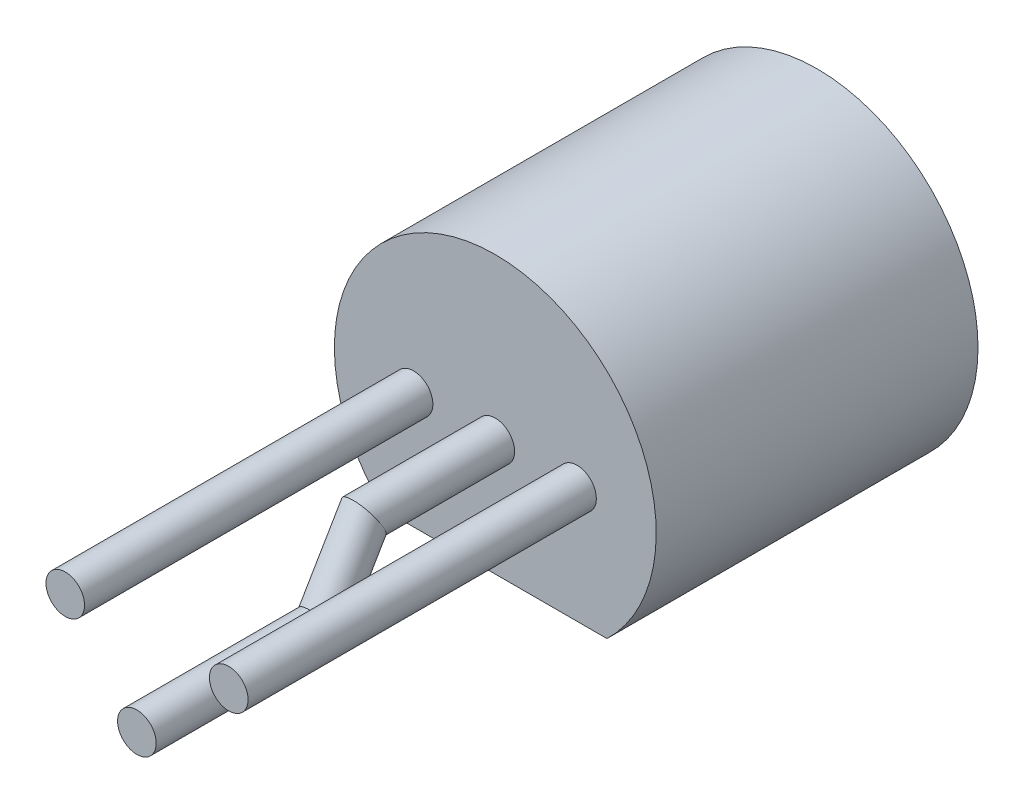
ISO-10303-21;
HEADER;
FILE_DESCRIPTION(('STEP AP214'),'2;1');
FILE_NAME('part.step','',(''),(''),'','','');
FILE_SCHEMA(('AUTOMOTIVE_DESIGN { 1 0 10303 214 1 1 1 1 }'));
ENDSEC;
DATA;
#1=APPLICATION_CONTEXT('core data for automotive mechanical design processes');
#2=APPLICATION_PROTOCOL_DEFINITION('international standard','automotive_design',2000,#1);
#3=PRODUCT_CONTEXT('',#1,'mechanical');
#4=PRODUCT('Part','Part','',(#3));
#5=PRODUCT_RELATED_PRODUCT_CATEGORY('part','',(#4));
#6=PRODUCT_DEFINITION_FORMATION('','',#4);
#7=PRODUCT_DEFINITION_CONTEXT('part definition',#1,'design');
#8=PRODUCT_DEFINITION('design','',#6,#7);
#9=PRODUCT_DEFINITION_SHAPE('','',#8);
#10=(LENGTH_UNIT() NAMED_UNIT(*) SI_UNIT(.MILLI.,.METRE.));
#11=(NAMED_UNIT(*) PLANE_ANGLE_UNIT() SI_UNIT($,.RADIAN.));
#12=(NAMED_UNIT(*) SI_UNIT($,.STERADIAN.) SOLID_ANGLE_UNIT());
#13=UNCERTAINTY_MEASURE_WITH_UNIT(LENGTH_MEASURE(1.E-05),#10,'distance_accuracy_value','');
#14=(GEOMETRIC_REPRESENTATION_CONTEXT(3) GLOBAL_UNCERTAINTY_ASSIGNED_CONTEXT((#13)) GLOBAL_UNIT_ASSIGNED_CONTEXT((#10,
#11,#12)) REPRESENTATION_CONTEXT('',''));
#15=CARTESIAN_POINT('',(0.,0.,0.));
#16=DIRECTION('',(0.,0.,1.));
#17=DIRECTION('',(1.,0.,0.));
#18=AXIS2_PLACEMENT_3D('',#15,#16,#17);
#19=CARTESIAN_POINT('',(0.,0.,5.));
#20=DIRECTION('',(0.,0.,1.));
#21=DIRECTION('',(1.,0.,0.));
#22=AXIS2_PLACEMENT_3D('',#19,#20,#21);
#23=PLANE('',#22);
#24=CARTESIAN_POINT('',(0.,0.,5.));
#25=DIRECTION('',(0.,0.,1.));
#26=DIRECTION('',(1.,0.,0.));
#27=AXIS2_PLACEMENT_3D('',#24,#25,#26);
#28=CIRCLE('',#27,0.3);
#29=CARTESIAN_POINT('',(0.3,0.,5.));
#30=VERTEX_POINT('',#29);
#31=EDGE_CURVE('E12',#30,#30,#28,.T.);
#32=ORIENTED_EDGE('',*,*,#31,.F.);
#33=EDGE_LOOP('',(#32));
#34=FACE_BOUND('',#33,.T.);
#35=CARTESIAN_POINT('',(1.27,0.,5.));
#36=DIRECTION('',(0.,0.,1.));
#37=DIRECTION('',(1.,0.,0.));
#38=AXIS2_PLACEMENT_3D('',#35,#36,#37);
#39=CIRCLE('',#38,0.3);
#40=CARTESIAN_POINT('',(1.57,0.,5.));
#41=VERTEX_POINT('',#40);
#42=EDGE_CURVE('E37',#41,#41,#39,.T.);
#43=ORIENTED_EDGE('',*,*,#42,.F.);
#44=EDGE_LOOP('',(#43));
#45=FACE_BOUND('',#44,.T.);
#46=CARTESIAN_POINT('',(0.,0.,5.));
#47=DIRECTION('',(0.,0.,1.));
#48=DIRECTION('',(1.,0.,0.));
#49=AXIS2_PLACEMENT_3D('',#46,#47,#48);
#50=CIRCLE('',#49,2.5);
#51=CARTESIAN_POINT('',(1.73493515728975,-1.8,5.));
#52=VERTEX_POINT('',#51);
#53=CARTESIAN_POINT('',(-1.73493515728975,-1.8,5.));
#54=VERTEX_POINT('',#53);
#55=EDGE_CURVE('E65',#52,#54,#50,.T.);
#56=ORIENTED_EDGE('',*,*,#55,.T.);
#57=DIRECTION('',(1.,0.,0.));
#58=VECTOR('',#57,1.);
#59=CARTESIAN_POINT('',(-1.73493515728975,-1.8,5.));
#60=LINE('',#59,#58);
#61=EDGE_CURVE('E48',#54,#52,#60,.T.);
#62=ORIENTED_EDGE('',*,*,#61,.T.);
#63=EDGE_LOOP('',(#56,#62));
#64=FACE_BOUND('',#63,.T.);
#65=CARTESIAN_POINT('',(-1.27,0.,5.));
#66=DIRECTION('',(0.,0.,1.));
#67=DIRECTION('',(1.,0.,0.));
#68=AXIS2_PLACEMENT_3D('',#65,#66,#67);
#69=CIRCLE('',#68,0.3);
#70=CARTESIAN_POINT('',(-0.97,0.,5.));
#71=VERTEX_POINT('',#70);
#72=EDGE_CURVE('E76',#71,#71,#69,.T.);
#73=ORIENTED_EDGE('',*,*,#72,.F.);
#74=EDGE_LOOP('',(#73));
#75=FACE_BOUND('',#74,.T.);
#76=ADVANCED_FACE('F33',(#34,#45,#64,#75),#23,.T.);
#77=CARTESIAN_POINT('',(0.,0.,5.));
#78=DIRECTION('',(0.,0.,-1.));
#79=DIRECTION('',(-1.,0.,0.));
#80=AXIS2_PLACEMENT_3D('',#77,#78,#79);
#81=CYLINDRICAL_SURFACE('',#80,2.5);
#82=CARTESIAN_POINT('',(0.,0.,0.));
#83=DIRECTION('',(0.,0.,1.));
#84=DIRECTION('',(1.,0.,0.));
#85=AXIS2_PLACEMENT_3D('',#82,#83,#84);
#86=CIRCLE('',#85,2.5);
#87=CARTESIAN_POINT('',(1.73493515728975,-1.8,0.));
#88=VERTEX_POINT('',#87);
#89=CARTESIAN_POINT('',(-1.73493515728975,-1.8,0.));
#90=VERTEX_POINT('',#89);
#91=EDGE_CURVE('E63',#88,#90,#86,.T.);
#92=ORIENTED_EDGE('',*,*,#91,.T.);
#93=DIRECTION('',(0.,0.,-1.));
#94=VECTOR('',#93,1.);
#95=CARTESIAN_POINT('',(-1.73493515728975,-1.8,5.));
#96=LINE('',#95,#94);
#97=EDGE_CURVE('E68',#54,#90,#96,.T.);
#98=ORIENTED_EDGE('',*,*,#97,.F.);
#99=ORIENTED_EDGE('',*,*,#55,.F.);
#100=DIRECTION('',(0.,0.,-1.));
#101=VECTOR('',#100,1.);
#102=CARTESIAN_POINT('',(1.73493515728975,-1.8,5.));
#103=LINE('',#102,#101);
#104=EDGE_CURVE('E72',#52,#88,#103,.T.);
#105=ORIENTED_EDGE('',*,*,#104,.T.);
#106=EDGE_LOOP('',(#92,#98,#99,#105));
#107=FACE_BOUND('',#106,.T.);
#108=ADVANCED_FACE('F35',(#107),#81,.T.);
#109=CARTESIAN_POINT('',(-1.73493515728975,-1.8,5.));
#110=DIRECTION('',(0.,1.,0.));
#111=DIRECTION('',(0.,0.,1.));
#112=AXIS2_PLACEMENT_3D('',#109,#110,#111);
#113=PLANE('',#112);
#114=DIRECTION('',(1.,0.,0.));
#115=VECTOR('',#114,1.);
#116=CARTESIAN_POINT('',(-1.73493515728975,-1.8,0.));
#117=LINE('',#116,#115);
#118=EDGE_CURVE('E60',#90,#88,#117,.T.);
#119=ORIENTED_EDGE('',*,*,#118,.T.);
#120=ORIENTED_EDGE('',*,*,#104,.F.);
#121=ORIENTED_EDGE('',*,*,#61,.F.);
#122=ORIENTED_EDGE('',*,*,#97,.T.);
#123=EDGE_LOOP('',(#119,#120,#121,#122));
#124=FACE_BOUND('',#123,.T.);
#125=ADVANCED_FACE('F69',(#124),#113,.F.);
#126=CARTESIAN_POINT('',(0.,0.,0.));
#127=DIRECTION('',(0.,0.,1.));
#128=DIRECTION('',(1.,0.,0.));
#129=AXIS2_PLACEMENT_3D('',#126,#127,#128);
#130=PLANE('',#129);
#131=ORIENTED_EDGE('',*,*,#91,.F.);
#132=ORIENTED_EDGE('',*,*,#118,.F.);
#133=EDGE_LOOP('',(#131,#132));
#134=FACE_BOUND('',#133,.T.);
#135=ADVANCED_FACE('F61',(#134),#130,.F.);
#136=CARTESIAN_POINT('',(-1.27,0.,10.4114232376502));
#137=DIRECTION('',(0.,0.,-1.));
#138=DIRECTION('',(-1.,0.,0.));
#139=AXIS2_PLACEMENT_3D('',#136,#137,#138);
#140=CYLINDRICAL_SURFACE('',#139,0.3);
#141=CARTESIAN_POINT('',(-1.27,0.,10.4114232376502));
#142=DIRECTION('',(0.,0.,1.));
#143=DIRECTION('',(1.,0.,0.));
#144=AXIS2_PLACEMENT_3D('',#141,#142,#143);
#145=CIRCLE('',#144,0.3);
#146=CARTESIAN_POINT('',(-0.97,0.,10.4114232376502));
#147=VERTEX_POINT('',#146);
#148=EDGE_CURVE('E73',#147,#147,#145,.T.);
#149=ORIENTED_EDGE('',*,*,#148,.F.);
#150=EDGE_LOOP('',(#149));
#151=FACE_BOUND('',#150,.T.);
#152=ORIENTED_EDGE('',*,*,#72,.T.);
#153=EDGE_LOOP('',(#152));
#154=FACE_BOUND('',#153,.T.);
#155=ADVANCED_FACE('F134',(#151,#154),#140,.T.);
#156=CARTESIAN_POINT('',(-1.27,0.,10.4114232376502));
#157=DIRECTION('',(0.,0.,1.));
#158=DIRECTION('',(1.,0.,0.));
#159=AXIS2_PLACEMENT_3D('',#156,#157,#158);
#160=PLANE('',#159);
#161=ORIENTED_EDGE('',*,*,#148,.T.);
#162=EDGE_LOOP('',(#161));
#163=FACE_BOUND('',#162,.T.);
#164=ADVANCED_FACE('F130',(#163),#160,.T.);
#165=CARTESIAN_POINT('',(1.27,0.,10.4114232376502));
#166=DIRECTION('',(0.,0.,-1.));
#167=DIRECTION('',(-1.,0.,0.));
#168=AXIS2_PLACEMENT_3D('',#165,#166,#167);
#169=CYLINDRICAL_SURFACE('',#168,0.3);
#170=CARTESIAN_POINT('',(1.27,0.,10.4114232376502));
#171=DIRECTION('',(0.,0.,-1.));
#172=DIRECTION('',(-1.,0.,0.));
#173=AXIS2_PLACEMENT_3D('',#170,#171,#172);
#174=CIRCLE('',#173,0.3);
#175=CARTESIAN_POINT('',(0.97,0.,10.4114232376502));
#176=VERTEX_POINT('',#175);
#177=EDGE_CURVE('E89',#176,#176,#174,.T.);
#178=ORIENTED_EDGE('',*,*,#177,.T.);
#179=EDGE_LOOP('',(#178));
#180=FACE_BOUND('',#179,.T.);
#181=ORIENTED_EDGE('',*,*,#42,.T.);
#182=EDGE_LOOP('',(#181));
#183=FACE_BOUND('',#182,.T.);
#184=ADVANCED_FACE('F126',(#180,#183),#169,.T.);
#185=CARTESIAN_POINT('',(1.27,0.,10.4114232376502));
#186=DIRECTION('',(0.,0.,1.));
#187=DIRECTION('',(-1.,0.,0.));
#188=AXIS2_PLACEMENT_3D('',#185,#186,#187);
#189=PLANE('',#188);
#190=ORIENTED_EDGE('',*,*,#177,.F.);
#191=EDGE_LOOP('',(#190));
#192=FACE_BOUND('',#191,.T.);
#193=ADVANCED_FACE('F122',(#192),#189,.T.);
#194=CARTESIAN_POINT('',(0.,-1.14244781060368,7.71128758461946));
#195=DIRECTION('',(0.,0.,1.));
#196=DIRECTION('',(0.,-1.,0.));
#197=AXIS2_PLACEMENT_3D('',#194,#195,#196);
#198=CYLINDRICAL_SURFACE('',#197,0.3);
#199=CARTESIAN_POINT('',(0.,-1.14244781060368,7.71128758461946));
#200=DIRECTION('',(0.,-0.496539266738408,0.868014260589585));
#201=DIRECTION('',(0.,-0.868014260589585,-0.496539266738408));
#202=AXIS2_PLACEMENT_3D('',#199,#200,#201);
#203=ELLIPSE('',#202,0.345616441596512,0.3);
#204=CARTESIAN_POINT('',(0.,-1.44244781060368,7.53967545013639));
#205=VERTEX_POINT('',#204);
#206=EDGE_CURVE('E96',#205,#205,#203,.F.);
#207=ORIENTED_EDGE('',*,*,#206,.F.);
#208=EDGE_LOOP('',(#207));
#209=FACE_BOUND('',#208,.T.);
#210=CARTESIAN_POINT('',(0.,-1.14244781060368,10.5689623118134));
#211=DIRECTION('',(0.,0.,1.));
#212=DIRECTION('',(0.,-1.,0.));
#213=AXIS2_PLACEMENT_3D('',#210,#211,#212);
#214=CIRCLE('',#213,0.3);
#215=CARTESIAN_POINT('',(0.,-1.44244781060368,10.5689623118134));
#216=VERTEX_POINT('',#215);
#217=EDGE_CURVE('E91',#216,#216,#214,.T.);
#218=ORIENTED_EDGE('',*,*,#217,.F.);
#219=EDGE_LOOP('',(#218));
#220=FACE_BOUND('',#219,.T.);
#221=ADVANCED_FACE('F117',(#209,#220),#198,.T.);
#222=CARTESIAN_POINT('',(0.,0.,7.0394781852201));
#223=DIRECTION('',(0.,-0.862006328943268,0.506897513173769));
#224=DIRECTION('',(0.,-0.506897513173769,-0.862006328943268));
#225=AXIS2_PLACEMENT_3D('',#222,#223,#224);
#226=CYLINDRICAL_SURFACE('',#225,0.3);
#227=CARTESIAN_POINT('',(0.,0.,7.0394781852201));
#228=DIRECTION('',(0.,-0.496539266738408,0.868014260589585));
#229=DIRECTION('',(0.,-0.868014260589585,-0.496539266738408));
#230=AXIS2_PLACEMENT_3D('',#227,#228,#229);
#231=ELLIPSE('',#230,0.345616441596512,0.3);
#232=CARTESIAN_POINT('',(0.,-0.3,6.86786605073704));
#233=VERTEX_POINT('',#232);
#234=EDGE_CURVE('E99',#233,#233,#231,.T.);
#235=ORIENTED_EDGE('',*,*,#234,.T.);
#236=EDGE_LOOP('',(#235));
#237=FACE_BOUND('',#236,.T.);
#238=ORIENTED_EDGE('',*,*,#206,.T.);
#239=EDGE_LOOP('',(#238));
#240=FACE_BOUND('',#239,.T.);
#241=ADVANCED_FACE('F103',(#237,#240),#226,.T.);
#242=CARTESIAN_POINT('',(0.,0.,7.88800632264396));
#243=DIRECTION('',(0.,0.,-1.));
#244=DIRECTION('',(-1.,0.,0.));
#245=AXIS2_PLACEMENT_3D('',#242,#243,#244);
#246=CYLINDRICAL_SURFACE('',#245,0.3);
#247=ORIENTED_EDGE('',*,*,#31,.T.);
#248=EDGE_LOOP('',(#247));
#249=FACE_BOUND('',#248,.T.);
#250=ORIENTED_EDGE('',*,*,#234,.F.);
#251=EDGE_LOOP('',(#250));
#252=FACE_BOUND('',#251,.T.);
#253=ADVANCED_FACE('F106',(#249,#252),#246,.T.);
#254=CARTESIAN_POINT('',(0.,-1.14244781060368,10.5689623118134));
#255=DIRECTION('',(0.,0.,1.));
#256=DIRECTION('',(0.,-1.,0.));
#257=AXIS2_PLACEMENT_3D('',#254,#255,#256);
#258=PLANE('',#257);
#259=ORIENTED_EDGE('',*,*,#217,.T.);
#260=EDGE_LOOP('',(#259));
#261=FACE_BOUND('',#260,.T.);
#262=ADVANCED_FACE('F108',(#261),#258,.T.);
#263=CLOSED_SHELL('',(#76,#108,#125,#135,#155,#164,#184,#193,#221,#241,#253,#262));
#264=MANIFOLD_SOLID_BREP('B2',#263);
#265=ADVANCED_BREP_SHAPE_REPRESENTATION('',(#18,#264),#14);
#266=SHAPE_DEFINITION_REPRESENTATION(#9,#265);
ENDSEC;
END-ISO-10303-21;
